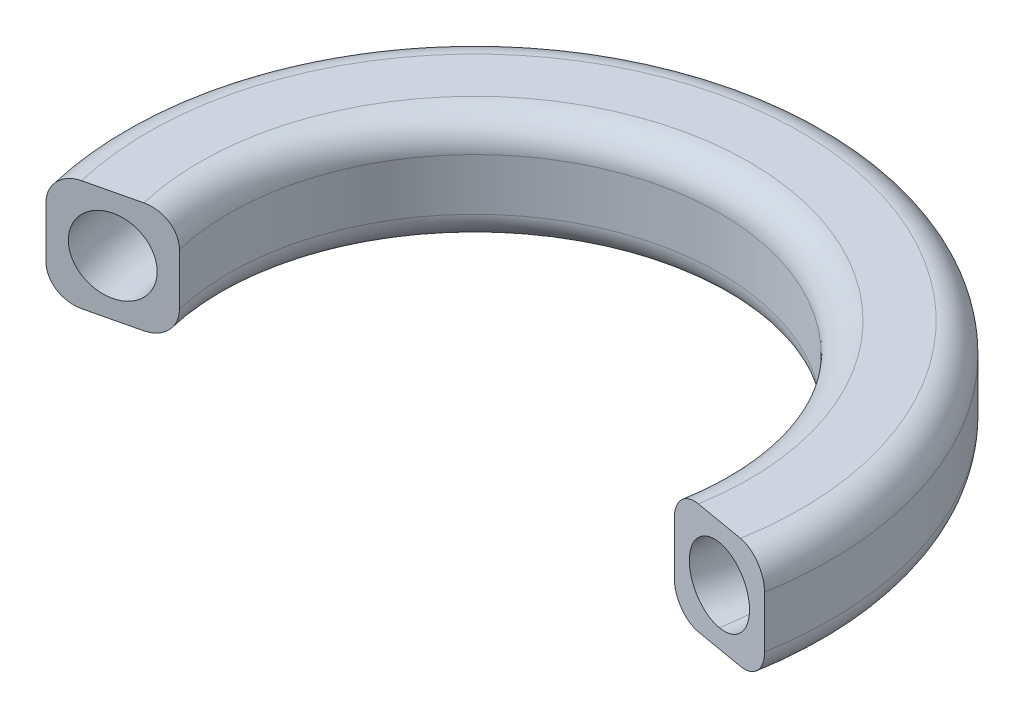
ISO-10303-21;
HEADER;
FILE_DESCRIPTION(('STEP AP214'),'2;1');
FILE_NAME('part.step','',(''),(''),'','','');
FILE_SCHEMA(('AUTOMOTIVE_DESIGN { 1 0 10303 214 1 1 1 1 }'));
ENDSEC;
DATA;
#1=APPLICATION_CONTEXT('core data for automotive mechanical design processes');
#2=APPLICATION_PROTOCOL_DEFINITION('international standard','automotive_design',2000,#1);
#3=PRODUCT_CONTEXT('',#1,'mechanical');
#4=PRODUCT('Part','Part','',(#3));
#5=PRODUCT_RELATED_PRODUCT_CATEGORY('part','',(#4));
#6=PRODUCT_DEFINITION_FORMATION('','',#4);
#7=PRODUCT_DEFINITION_CONTEXT('part definition',#1,'design');
#8=PRODUCT_DEFINITION('design','',#6,#7);
#9=PRODUCT_DEFINITION_SHAPE('','',#8);
#10=(LENGTH_UNIT() NAMED_UNIT(*) SI_UNIT(.MILLI.,.METRE.));
#11=(NAMED_UNIT(*) PLANE_ANGLE_UNIT() SI_UNIT($,.RADIAN.));
#12=(NAMED_UNIT(*) SI_UNIT($,.STERADIAN.) SOLID_ANGLE_UNIT());
#13=UNCERTAINTY_MEASURE_WITH_UNIT(LENGTH_MEASURE(1.E-05),#10,'distance_accuracy_value','');
#14=(GEOMETRIC_REPRESENTATION_CONTEXT(3) GLOBAL_UNCERTAINTY_ASSIGNED_CONTEXT((#13)) GLOBAL_UNIT_ASSIGNED_CONTEXT((#10,
#11,#12)) REPRESENTATION_CONTEXT('',''));
#15=CARTESIAN_POINT('',(0.,0.,0.));
#16=DIRECTION('',(0.,0.,1.));
#17=DIRECTION('',(1.,0.,0.));
#18=AXIS2_PLACEMENT_3D('',#15,#16,#17);
#19=CARTESIAN_POINT('',(-75.0783718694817,-15.,-3.46469167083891));
#20=DIRECTION('',(-0.230979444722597,0.,-0.972958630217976));
#21=DIRECTION('',(-0.972958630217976,0.,0.230979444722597));
#22=AXIS2_PLACEMENT_3D('',#19,#20,#21);
#23=PLANE('',#22);
#24=DIRECTION('',(0.,1.,0.));
#25=VECTOR('',#24,1.);
#26=CARTESIAN_POINT('',(-104.267130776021,15.,3.464691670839));
#27=LINE('',#26,#25);
#28=CARTESIAN_POINT('',(-104.267130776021,-7.,3.464691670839));
#29=VERTEX_POINT('',#28);
#30=CARTESIAN_POINT('',(-104.267130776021,7.,3.464691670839));
#31=VERTEX_POINT('',#30);
#32=EDGE_CURVE('E211',#29,#31,#27,.T.);
#33=ORIENTED_EDGE('',*,*,#32,.F.);
#34=CARTESIAN_POINT('',(-96.4834617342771,-7.,1.61685611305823));
#35=DIRECTION('',(-0.230979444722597,0.,-0.972958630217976));
#36=DIRECTION('',(-0.972958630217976,0.,0.230979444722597));
#37=AXIS2_PLACEMENT_3D('',#34,#35,#36);
#38=CIRCLE('',#37,8.);
#39=CARTESIAN_POINT('',(-96.4834617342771,-15.,1.61685611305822));
#40=VERTEX_POINT('',#39);
#41=EDGE_CURVE('E162',#29,#40,#38,.F.);
#42=ORIENTED_EDGE('',*,*,#41,.T.);
#43=DIRECTION('',(-0.972958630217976,0.,0.230979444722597));
#44=VECTOR('',#43,1.);
#45=CARTESIAN_POINT('',(-75.0783718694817,-15.,-3.46469167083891));
#46=LINE('',#45,#44);
#47=CARTESIAN_POINT('',(-82.8620409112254,-15.,-1.61685611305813));
#48=VERTEX_POINT('',#47);
#49=EDGE_CURVE('E207',#48,#40,#46,.T.);
#50=ORIENTED_EDGE('',*,*,#49,.F.);
#51=CARTESIAN_POINT('',(-82.8620409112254,-7.,-1.61685611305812));
#52=DIRECTION('',(-0.230979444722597,0.,-0.972958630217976));
#53=DIRECTION('',(-0.972958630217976,0.,0.230979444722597));
#54=AXIS2_PLACEMENT_3D('',#51,#52,#53);
#55=CIRCLE('',#54,8.);
#56=CARTESIAN_POINT('',(-75.0783718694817,-7.,-3.46469167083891));
#57=VERTEX_POINT('',#56);
#58=EDGE_CURVE('E156',#48,#57,#55,.F.);
#59=ORIENTED_EDGE('',*,*,#58,.T.);
#60=DIRECTION('',(0.,-1.,0.));
#61=VECTOR('',#60,1.);
#62=CARTESIAN_POINT('',(-75.0783718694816,15.,-3.46469167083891));
#63=LINE('',#62,#61);
#64=CARTESIAN_POINT('',(-75.0783718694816,7.,-3.46469167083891));
#65=VERTEX_POINT('',#64);
#66=EDGE_CURVE('E139',#65,#57,#63,.T.);
#67=ORIENTED_EDGE('',*,*,#66,.F.);
#68=CARTESIAN_POINT('',(-82.8620409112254,7.,-1.61685611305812));
#69=DIRECTION('',(-0.230979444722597,0.,-0.972958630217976));
#70=DIRECTION('',(-0.972958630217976,0.,0.230979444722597));
#71=AXIS2_PLACEMENT_3D('',#68,#69,#70);
#72=CIRCLE('',#71,8.);
#73=CARTESIAN_POINT('',(-82.8620409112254,15.,-1.61685611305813));
#74=VERTEX_POINT('',#73);
#75=EDGE_CURVE('E153',#65,#74,#72,.F.);
#76=ORIENTED_EDGE('',*,*,#75,.T.);
#77=DIRECTION('',(0.972958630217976,0.,-0.230979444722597));
#78=VECTOR('',#77,1.);
#79=CARTESIAN_POINT('',(-75.0783718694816,15.,-3.46469167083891));
#80=LINE('',#79,#78);
#81=CARTESIAN_POINT('',(-96.4834617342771,15.,1.61685611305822));
#82=VERTEX_POINT('',#81);
#83=EDGE_CURVE('E219',#82,#74,#80,.T.);
#84=ORIENTED_EDGE('',*,*,#83,.F.);
#85=CARTESIAN_POINT('',(-96.4834617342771,7.,1.61685611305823));
#86=DIRECTION('',(-0.230979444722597,0.,-0.972958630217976));
#87=DIRECTION('',(-0.972958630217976,0.,0.230979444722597));
#88=AXIS2_PLACEMENT_3D('',#85,#86,#87);
#89=CIRCLE('',#88,8.);
#90=EDGE_CURVE('E159',#82,#31,#89,.F.);
#91=ORIENTED_EDGE('',*,*,#90,.T.);
#92=EDGE_LOOP('',(#33,#42,#50,#59,#67,#76,#84,#91));
#93=FACE_BOUND('',#92,.T.);
#94=CARTESIAN_POINT('',(-89.6727513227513,0.,0.));
#95=DIRECTION('',(0.230979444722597,0.,0.972958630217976));
#96=DIRECTION('',(0.972958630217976,0.,-0.230979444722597));
#97=AXIS2_PLACEMENT_3D('',#94,#95,#96);
#98=CIRCLE('',#97,10.);
#99=CARTESIAN_POINT('',(-79.9431650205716,0.,-2.30979444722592));
#100=VERTEX_POINT('',#99);
#101=EDGE_CURVE('E123',#100,#100,#98,.T.);
#102=ORIENTED_EDGE('',*,*,#101,.F.);
#103=EDGE_LOOP('',(#102));
#104=FACE_BOUND('',#103,.T.);
#105=ADVANCED_FACE('F34',(#93,#104),#23,.F.);
#106=CARTESIAN_POINT('',(-10.5307952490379,0.,-18.7882243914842));
#107=DIRECTION('',(0.,1.,0.));
#108=DIRECTION('',(0.,0.,1.));
#109=AXIS2_PLACEMENT_3D('',#106,#107,#108);
#110=CYLINDRICAL_SURFACE('',#109,66.34154281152);
#111=ORIENTED_EDGE('',*,*,#66,.T.);
#112=CARTESIAN_POINT('',(-10.5307952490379,-7.,-18.7882243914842));
#113=DIRECTION('',(0.,1.,0.));
#114=DIRECTION('',(0.,0.,1.));
#115=AXIS2_PLACEMENT_3D('',#112,#113,#114);
#116=CIRCLE('',#115,66.34154281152);
#117=CARTESIAN_POINT('',(54.8369442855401,-7.,-7.4630784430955));
#118=VERTEX_POINT('',#117);
#119=EDGE_CURVE('E11',#57,#118,#116,.F.);
#120=ORIENTED_EDGE('',*,*,#119,.T.);
#121=DIRECTION('',(0.,-1.,0.));
#122=VECTOR('',#121,1.);
#123=CARTESIAN_POINT('',(54.8369442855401,15.,-7.4630784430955));
#124=LINE('',#123,#122);
#125=CARTESIAN_POINT('',(54.8369442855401,7.,-7.4630784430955));
#126=VERTEX_POINT('',#125);
#127=EDGE_CURVE('E198',#126,#118,#124,.T.);
#128=ORIENTED_EDGE('',*,*,#127,.F.);
#129=CARTESIAN_POINT('',(-10.5307952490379,7.,-18.7882243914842));
#130=DIRECTION('',(0.,-1.,0.));
#131=DIRECTION('',(0.,0.,-1.));
#132=AXIS2_PLACEMENT_3D('',#129,#130,#131);
#133=CIRCLE('',#132,66.34154281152);
#134=EDGE_CURVE('E43',#126,#65,#133,.F.);
#135=ORIENTED_EDGE('',*,*,#134,.T.);
#136=EDGE_LOOP('',(#111,#120,#128,#135));
#137=FACE_BOUND('',#136,.T.);
#138=ADVANCED_FACE('F195',(#137),#110,.F.);
#139=CARTESIAN_POINT('',(54.8369442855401,15.,-7.4630784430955));
#140=DIRECTION('',(0.,-1.,0.));
#141=DIRECTION('',(0.,0.,-1.));
#142=AXIS2_PLACEMENT_3D('',#139,#140,#141);
#143=PLANE('',#142);
#144=DIRECTION('',(-0.985321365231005,0.,-0.170709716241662));
#145=VECTOR('',#144,1.);
#146=CARTESIAN_POINT('',(54.8369442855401,15.,-7.4630784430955));
#147=LINE('',#146,#145);
#148=CARTESIAN_POINT('',(76.5140143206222,15.,-3.70746468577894));
#149=VERTEX_POINT('',#148);
#150=CARTESIAN_POINT('',(62.7195152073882,15.,-6.0974007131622));
#151=VERTEX_POINT('',#150);
#152=EDGE_CURVE('E230',#149,#151,#147,.T.);
#153=ORIENTED_EDGE('',*,*,#152,.F.);
#154=CARTESIAN_POINT('',(-10.5307952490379,15.,-18.7882243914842));
#155=DIRECTION('',(0.,-1.,0.));
#156=DIRECTION('',(0.,0.,-1.));
#157=AXIS2_PLACEMENT_3D('',#154,#155,#156);
#158=CIRCLE('',#157,88.34154281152);
#159=EDGE_CURVE('E184',#149,#82,#158,.F.);
#160=ORIENTED_EDGE('',*,*,#159,.T.);
#161=ORIENTED_EDGE('',*,*,#83,.T.);
#162=CARTESIAN_POINT('',(-10.5307952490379,15.,-18.7882243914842));
#163=DIRECTION('',(0.,-1.,0.));
#164=DIRECTION('',(0.,0.,-1.));
#165=AXIS2_PLACEMENT_3D('',#162,#163,#164);
#166=CIRCLE('',#165,74.34154281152);
#167=EDGE_CURVE('E50',#74,#151,#166,.T.);
#168=ORIENTED_EDGE('',*,*,#167,.T.);
#169=EDGE_LOOP('',(#153,#160,#161,#168));
#170=FACE_BOUND('',#169,.T.);
#171=ADVANCED_FACE('F254',(#170),#143,.F.);
#172=CARTESIAN_POINT('',(-10.5307952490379,0.,-18.7882243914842));
#173=DIRECTION('',(0.,1.,0.));
#174=DIRECTION('',(0.,0.,1.));
#175=AXIS2_PLACEMENT_3D('',#172,#173,#174);
#176=CYLINDRICAL_SURFACE('',#175,96.34154281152);
#177=DIRECTION('',(0.,1.,0.));
#178=VECTOR('',#177,1.);
#179=CARTESIAN_POINT('',(84.3965852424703,15.,-2.34178695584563));
#180=LINE('',#179,#178);
#181=CARTESIAN_POINT('',(84.3965852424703,-7.,-2.34178695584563));
#182=VERTEX_POINT('',#181);
#183=CARTESIAN_POINT('',(84.3965852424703,7.,-2.34178695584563));
#184=VERTEX_POINT('',#183);
#185=EDGE_CURVE('E228',#182,#184,#180,.T.);
#186=ORIENTED_EDGE('',*,*,#185,.F.);
#187=CARTESIAN_POINT('',(-10.5307952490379,-7.,-18.7882243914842));
#188=DIRECTION('',(0.,1.,0.));
#189=DIRECTION('',(0.,0.,1.));
#190=AXIS2_PLACEMENT_3D('',#187,#188,#189);
#191=CIRCLE('',#190,96.34154281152);
#192=EDGE_CURVE('E149',#182,#29,#191,.T.);
#193=ORIENTED_EDGE('',*,*,#192,.T.);
#194=ORIENTED_EDGE('',*,*,#32,.T.);
#195=CARTESIAN_POINT('',(-10.5307952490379,7.,-18.7882243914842));
#196=DIRECTION('',(0.,-1.,0.));
#197=DIRECTION('',(0.,0.,-1.));
#198=AXIS2_PLACEMENT_3D('',#195,#196,#197);
#199=CIRCLE('',#198,96.34154281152);
#200=EDGE_CURVE('E147',#31,#184,#199,.T.);
#201=ORIENTED_EDGE('',*,*,#200,.T.);
#202=EDGE_LOOP('',(#186,#193,#194,#201));
#203=FACE_BOUND('',#202,.T.);
#204=ADVANCED_FACE('F258',(#203),#176,.T.);
#205=CARTESIAN_POINT('',(54.8369442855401,-15.,-7.4630784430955));
#206=DIRECTION('',(0.,1.,0.));
#207=DIRECTION('',(0.,0.,1.));
#208=AXIS2_PLACEMENT_3D('',#205,#206,#207);
#209=PLANE('',#208);
#210=ORIENTED_EDGE('',*,*,#49,.T.);
#211=CARTESIAN_POINT('',(-10.5307952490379,-15.,-18.7882243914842));
#212=DIRECTION('',(0.,1.,0.));
#213=DIRECTION('',(0.,0.,1.));
#214=AXIS2_PLACEMENT_3D('',#211,#212,#213);
#215=CIRCLE('',#214,88.34154281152);
#216=CARTESIAN_POINT('',(76.5140143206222,-15.,-3.70746468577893));
#217=VERTEX_POINT('',#216);
#218=EDGE_CURVE('E169',#40,#217,#215,.F.);
#219=ORIENTED_EDGE('',*,*,#218,.T.);
#220=DIRECTION('',(0.985321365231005,0.,0.170709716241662));
#221=VECTOR('',#220,1.);
#222=CARTESIAN_POINT('',(54.8369442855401,-15.,-7.4630784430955));
#223=LINE('',#222,#221);
#224=CARTESIAN_POINT('',(62.7195152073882,-15.,-6.0974007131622));
#225=VERTEX_POINT('',#224);
#226=EDGE_CURVE('E224',#225,#217,#223,.T.);
#227=ORIENTED_EDGE('',*,*,#226,.F.);
#228=CARTESIAN_POINT('',(-10.5307952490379,-15.,-18.7882243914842));
#229=DIRECTION('',(0.,1.,0.));
#230=DIRECTION('',(0.,0.,1.));
#231=AXIS2_PLACEMENT_3D('',#228,#229,#230);
#232=CIRCLE('',#231,74.34154281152);
#233=EDGE_CURVE('E165',#225,#48,#232,.T.);
#234=ORIENTED_EDGE('',*,*,#233,.T.);
#235=EDGE_LOOP('',(#210,#219,#227,#234));
#236=FACE_BOUND('',#235,.T.);
#237=ADVANCED_FACE('F247',(#236),#209,.F.);
#238=CARTESIAN_POINT('',(54.8369442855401,-15.,-7.4630784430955));
#239=DIRECTION('',(-0.170709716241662,0.,0.985321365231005));
#240=DIRECTION('',(0.985321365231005,0.,0.170709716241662));
#241=AXIS2_PLACEMENT_3D('',#238,#239,#240);
#242=PLANE('',#241);
#243=CARTESIAN_POINT('',(69.6167647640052,0.,-4.90243269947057));
#244=DIRECTION('',(-0.170709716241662,0.,0.985321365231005));
#245=DIRECTION('',(0.985321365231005,0.,0.170709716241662));
#246=AXIS2_PLACEMENT_3D('',#243,#244,#245);
#247=CIRCLE('',#246,10.);
#248=CARTESIAN_POINT('',(69.6167647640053,10.,-4.90243269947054));
#249=VERTEX_POINT('',#248);
#250=CARTESIAN_POINT('',(69.6167647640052,-10.,-4.90243269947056));
#251=VERTEX_POINT('',#250);
#252=EDGE_CURVE('E128',#249,#251,#247,.T.);
#253=ORIENTED_EDGE('',*,*,#252,.F.);
#254=CARTESIAN_POINT('',(69.6167647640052,0.,-4.90243269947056));
#255=DIRECTION('',(0.170709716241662,0.,-0.985321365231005));
#256=DIRECTION('',(-0.985321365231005,0.,-0.170709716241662));
#257=AXIS2_PLACEMENT_3D('',#254,#255,#256);
#258=CIRCLE('',#257,10.);
#259=EDGE_CURVE('E112',#249,#251,#258,.T.);
#260=ORIENTED_EDGE('',*,*,#259,.T.);
#261=EDGE_LOOP('',(#253,#260));
#262=FACE_BOUND('',#261,.T.);
#263=ORIENTED_EDGE('',*,*,#226,.T.);
#264=CARTESIAN_POINT('',(76.5140143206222,-7.,-3.70746468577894));
#265=DIRECTION('',(-0.170709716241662,0.,0.985321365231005));
#266=DIRECTION('',(0.985321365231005,0.,0.170709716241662));
#267=AXIS2_PLACEMENT_3D('',#264,#265,#266);
#268=CIRCLE('',#267,8.);
#269=EDGE_CURVE('E179',#217,#182,#268,.T.);
#270=ORIENTED_EDGE('',*,*,#269,.T.);
#271=ORIENTED_EDGE('',*,*,#185,.T.);
#272=CARTESIAN_POINT('',(76.5140143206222,7.,-3.70746468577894));
#273=DIRECTION('',(-0.170709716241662,0.,0.985321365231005));
#274=DIRECTION('',(0.985321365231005,0.,0.170709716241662));
#275=AXIS2_PLACEMENT_3D('',#272,#273,#274);
#276=CIRCLE('',#275,8.);
#277=EDGE_CURVE('E57',#184,#149,#276,.T.);
#278=ORIENTED_EDGE('',*,*,#277,.T.);
#279=ORIENTED_EDGE('',*,*,#152,.T.);
#280=CARTESIAN_POINT('',(62.7195152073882,7.,-6.0974007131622));
#281=DIRECTION('',(-0.170709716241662,0.,0.985321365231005));
#282=DIRECTION('',(0.985321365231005,0.,0.170709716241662));
#283=AXIS2_PLACEMENT_3D('',#280,#281,#282);
#284=CIRCLE('',#283,8.);
#285=EDGE_CURVE('E172',#151,#126,#284,.T.);
#286=ORIENTED_EDGE('',*,*,#285,.T.);
#287=ORIENTED_EDGE('',*,*,#127,.T.);
#288=CARTESIAN_POINT('',(62.7195152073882,-7.,-6.0974007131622));
#289=DIRECTION('',(-0.170709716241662,0.,0.985321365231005));
#290=DIRECTION('',(0.985321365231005,0.,0.170709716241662));
#291=AXIS2_PLACEMENT_3D('',#288,#289,#290);
#292=CIRCLE('',#291,8.);
#293=EDGE_CURVE('E175',#118,#225,#292,.T.);
#294=ORIENTED_EDGE('',*,*,#293,.T.);
#295=EDGE_LOOP('',(#263,#270,#271,#278,#279,#286,#287,#294));
#296=FACE_BOUND('',#295,.T.);
#297=ADVANCED_FACE('F133',(#262,#296),#242,.T.);
#298=CARTESIAN_POINT('',(-89.6070662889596,0.,0.285244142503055));
#299=DIRECTION('',(-0.217817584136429,0.,-0.975989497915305));
#300=DIRECTION('',(-0.975989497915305,0.,0.217817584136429));
#301=AXIS2_PLACEMENT_3D('',#298,#299,#300);
#302=CIRCLE('',#301,10.);
#303=CARTESIAN_POINT('',(-10.5089790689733,15.,-18.0793745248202));
#304=DIRECTION('',(0.,-1.,0.));
#305=AXIS1_PLACEMENT('',#303,#304);
#306=SURFACE_OF_REVOLUTION('',#302,#305);
#307=CARTESIAN_POINT('',(78.0634470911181,0.,-39.8204124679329));
#308=CARTESIAN_POINT('',(78.0634490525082,-0.280953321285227,-39.820412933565));
#309=CARTESIAN_POINT('',(78.0519223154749,-0.561873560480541,-39.8176764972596));
#310=CARTESIAN_POINT('',(78.0058958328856,-1.12181107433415,-39.8067498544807));
#311=CARTESIAN_POINT('',(77.9713900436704,-1.40082782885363,-39.7985582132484));
#312=CARTESIAN_POINT('',(77.8795932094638,-1.95517499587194,-39.7767657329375));
#313=CARTESIAN_POINT('',(77.8222779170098,-2.23050116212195,-39.7631591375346));
#314=CARTESIAN_POINT('',(77.6852698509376,-2.77521418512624,-39.730633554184));
#315=CARTESIAN_POINT('',(77.6055766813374,-3.04460093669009,-39.7117144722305));
#316=CARTESIAN_POINT('',(77.4244252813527,-3.5753795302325,-39.668709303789));
#317=CARTESIAN_POINT('',(77.3229778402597,-3.83677526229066,-39.6446257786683));
#318=CARTESIAN_POINT('',(77.0990142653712,-4.34985680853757,-39.5914570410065));
#319=CARTESIAN_POINT('',(76.9764977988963,-4.60154246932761,-39.5623717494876));
#320=CARTESIAN_POINT('',(76.7113012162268,-5.09334893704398,-39.4994143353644));
#321=CARTESIAN_POINT('',(76.5686260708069,-5.33347257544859,-39.4655433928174));
#322=CARTESIAN_POINT('',(76.2641067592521,-5.80050958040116,-39.3932508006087));
#323=CARTESIAN_POINT('',(76.102263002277,-6.02742322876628,-39.3548292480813));
#324=CARTESIAN_POINT('',(75.7605346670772,-6.46645826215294,-39.2737032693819));
#325=CARTESIAN_POINT('',(75.5806480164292,-6.67857794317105,-39.2309983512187));
#326=CARTESIAN_POINT('',(75.2041280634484,-7.08648858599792,-39.1416128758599));
#327=CARTESIAN_POINT('',(75.0074947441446,-7.28227953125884,-39.0949323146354));
#328=CARTESIAN_POINT('',(74.5988715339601,-7.65614785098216,-38.9979255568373));
#329=CARTESIAN_POINT('',(74.3868810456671,-7.83422453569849,-38.9475992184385));
#330=CARTESIAN_POINT('',(73.9490574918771,-8.171389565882,-38.8436603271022));
#331=CARTESIAN_POINT('',(73.7232244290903,-8.33047791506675,-38.7900477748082));
#332=CARTESIAN_POINT('',(73.2593255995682,-8.62853248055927,-38.6799186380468));
#333=CARTESIAN_POINT('',(73.021260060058,-8.76749907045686,-38.6234021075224));
#334=CARTESIAN_POINT('',(72.5345849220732,-9.02432566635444,-38.5078658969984));
#335=CARTESIAN_POINT('',(72.2859753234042,-9.14218567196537,-38.4488462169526));
#336=CARTESIAN_POINT('',(71.7799800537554,-9.35596096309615,-38.3287234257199));
#337=CARTESIAN_POINT('',(71.5225944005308,-9.45187629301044,-38.267620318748));
#338=CARTESIAN_POINT('',(71.0008763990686,-9.62108063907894,-38.1437649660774));
#339=CARTESIAN_POINT('',(70.7365440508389,-9.69436965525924,-38.0810127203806));
#340=CARTESIAN_POINT('',(70.2028113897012,-9.81780045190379,-37.9543050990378));
#341=CARTESIAN_POINT('',(69.9334110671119,-9.8679421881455,-37.8903497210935));
#342=CARTESIAN_POINT('',(69.3914582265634,-9.94472174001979,-37.7616906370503));
#343=CARTESIAN_POINT('',(69.1189057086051,-9.97135955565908,-37.6969869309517));
#344=CARTESIAN_POINT('',(68.5725866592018,-10.0009418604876,-37.5672913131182));
#345=CARTESIAN_POINT('',(68.2988201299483,-10.0038863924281,-37.5022994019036));
#346=CARTESIAN_POINT('',(67.752018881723,-9.98606130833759,-37.3724893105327));
#347=CARTESIAN_POINT('',(67.4789841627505,-9.96529169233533,-37.3076711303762));
#348=CARTESIAN_POINT('',(66.935587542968,-9.90018595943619,-37.178669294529));
#349=CARTESIAN_POINT('',(66.665225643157,-9.85584983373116,-37.1144856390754));
#350=CARTESIAN_POINT('',(66.1290968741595,-9.74392627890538,-36.9872091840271));
#351=CARTESIAN_POINT('',(65.8633300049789,-9.67633884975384,-36.9241163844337));
#352=CARTESIAN_POINT('',(65.3382804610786,-9.51839311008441,-36.7994701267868));
#353=CARTESIAN_POINT('',(65.0789977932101,-9.42803477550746,-36.7379166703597));
#354=CARTESIAN_POINT('',(64.5687602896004,-9.22518965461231,-36.6167867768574));
#355=CARTESIAN_POINT('',(64.3178054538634,-9.11270286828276,-36.5572103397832));
#356=CARTESIAN_POINT('',(63.8260078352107,-8.86640059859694,-36.4404580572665));
#357=CARTESIAN_POINT('',(63.5851650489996,-8.73258512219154,-36.3832822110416));
#358=CARTESIAN_POINT('',(63.1153036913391,-8.44457679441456,-36.2717375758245));
#359=CARTESIAN_POINT('',(62.8862851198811,-8.29038394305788,-36.2173687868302));
#360=CARTESIAN_POINT('',(62.4417004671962,-7.96271715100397,-36.1118248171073));
#361=CARTESIAN_POINT('',(62.2261343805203,-7.78924321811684,-36.0606496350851));
#362=CARTESIAN_POINT('',(61.8099871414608,-7.42424750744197,-35.9618566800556));
#363=CARTESIAN_POINT('',(61.6094059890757,-7.23272572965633,-35.9142389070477));
#364=CARTESIAN_POINT('',(61.2246546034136,-6.83299590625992,-35.822899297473));
#365=CARTESIAN_POINT('',(61.0404843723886,-6.62478785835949,-35.7791774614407));
#366=CARTESIAN_POINT('',(60.6898642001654,-6.19316575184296,-35.6959405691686));
#367=CARTESIAN_POINT('',(60.5234142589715,-5.96975169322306,-35.6564255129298));
#368=CARTESIAN_POINT('',(60.2094180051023,-5.50930587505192,-35.5818831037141));
#369=CARTESIAN_POINT('',(60.061871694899,-5.27227411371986,-35.546855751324));
#370=CARTESIAN_POINT('',(59.7867316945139,-4.78627807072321,-35.4815377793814));
#371=CARTESIAN_POINT('',(59.6591380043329,-4.5373137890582,-35.451247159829));
#372=CARTESIAN_POINT('',(59.4248103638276,-4.02922270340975,-35.3956180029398));
#373=CARTESIAN_POINT('',(59.3180764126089,-3.77009589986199,-35.3702794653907));
#374=CARTESIAN_POINT('',(59.1262270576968,-3.24352199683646,-35.32473461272));
#375=CARTESIAN_POINT('',(59.0411116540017,-2.97607489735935,-35.304528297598));
#376=CARTESIAN_POINT('',(58.8931045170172,-2.43476180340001,-35.2693915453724));
#377=CARTESIAN_POINT('',(58.8302127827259,-2.16089580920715,-35.2544611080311));
#378=CARTESIAN_POINT('',(58.7271001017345,-1.60869193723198,-35.2299822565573));
#379=CARTESIAN_POINT('',(58.6868791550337,-1.3303540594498,-35.2204338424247));
#380=CARTESIAN_POINT('',(58.6293939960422,-0.771185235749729,-35.2067869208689));
#381=CARTESIAN_POINT('',(58.6121297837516,-0.490354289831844,-35.2026884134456));
#382=CARTESIAN_POINT('',(58.6006808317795,0.071804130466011,-35.199970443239));
#383=CARTESIAN_POINT('',(58.6064960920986,0.353131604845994,-35.2013509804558));
#384=CARTESIAN_POINT('',(58.6411647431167,0.914283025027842,-35.2095812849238));
#385=CARTESIAN_POINT('',(58.6700181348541,1.19410697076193,-35.2164310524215));
#386=CARTESIAN_POINT('',(58.7505579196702,1.750261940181,-35.2355511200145));
#387=CARTESIAN_POINT('',(58.8022443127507,2.02659296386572,-35.2478214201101));
#388=CARTESIAN_POINT('',(58.9280826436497,2.57379755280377,-35.2776953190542));
#389=CARTESIAN_POINT('',(59.0022345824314,2.84467111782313,-35.2952989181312));
#390=CARTESIAN_POINT('',(59.172476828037,3.37903502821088,-35.3357142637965));
#391=CARTESIAN_POINT('',(59.2685671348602,3.64252537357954,-35.3585260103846));
#392=CARTESIAN_POINT('',(59.4820029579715,4.160249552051,-35.4091954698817));
#393=CARTESIAN_POINT('',(59.5993484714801,4.41448338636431,-35.4370531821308));
#394=CARTESIAN_POINT('',(59.8544604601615,4.91188712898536,-35.4976165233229));
#395=CARTESIAN_POINT('',(59.9922269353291,5.15505703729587,-35.5303221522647));
#396=CARTESIAN_POINT('',(60.287201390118,5.62860410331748,-35.6003488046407));
#397=CARTESIAN_POINT('',(60.4444093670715,5.85898126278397,-35.6376698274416));
#398=CARTESIAN_POINT('',(60.7771491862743,6.30530502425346,-35.7166619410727));
#399=CARTESIAN_POINT('',(60.9526810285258,6.52125162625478,-35.7583330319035));
#400=CARTESIAN_POINT('',(61.3208207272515,6.93717910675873,-35.8457290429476));
#401=CARTESIAN_POINT('',(61.5134285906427,7.13715997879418,-35.891453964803));
#402=CARTESIAN_POINT('',(61.9143509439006,7.51973415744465,-35.98663254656));
#403=CARTESIAN_POINT('',(62.1226654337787,7.70232746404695,-36.0360862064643));
#404=CARTESIAN_POINT('',(62.5535201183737,8.0488284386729,-36.1383706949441));
#405=CARTESIAN_POINT('',(62.7760603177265,8.21273610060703,-36.1912015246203));
#406=CARTESIAN_POINT('',(63.2337842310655,8.52070043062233,-36.2998647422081));
#407=CARTESIAN_POINT('',(63.4689679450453,8.66475709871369,-36.3556971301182));
#408=CARTESIAN_POINT('',(63.950306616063,8.9319951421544,-36.4699664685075));
#409=CARTESIAN_POINT('',(64.1964615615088,9.05517653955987,-36.5284034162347));
#410=CARTESIAN_POINT('',(64.6979929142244,9.27978848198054,-36.6474664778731));
#411=CARTESIAN_POINT('',(64.9533693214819,9.38121902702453,-36.7080925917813));
#412=CARTESIAN_POINT('',(65.4715279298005,9.5616081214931,-36.8311029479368));
#413=CARTESIAN_POINT('',(65.7343101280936,9.64056667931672,-36.8934871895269));
#414=CARTESIAN_POINT('',(66.2654121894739,9.77545050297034,-37.0195703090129));
#415=CARTESIAN_POINT('',(66.5337320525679,9.83137576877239,-37.0832691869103));
#416=CARTESIAN_POINT('',(67.074002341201,9.9197954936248,-37.2115288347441));
#417=CARTESIAN_POINT('',(67.34595277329,9.95228991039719,-37.2760896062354));
#418=CARTESIAN_POINT('',(67.8915503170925,9.99361675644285,-37.4056139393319));
#419=CARTESIAN_POINT('',(68.1651974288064,10.0024491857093,-37.4705775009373));
#420=CARTESIAN_POINT('',(68.7122423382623,9.99638926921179,-37.6004454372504));
#421=CARTESIAN_POINT('',(68.9856401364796,9.98149696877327,-37.665349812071));
#422=CARTESIAN_POINT('',(69.5302432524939,9.92809355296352,-37.7946380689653));
#423=CARTESIAN_POINT('',(69.8014485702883,9.88958243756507,-37.8590219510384));
#424=CARTESIAN_POINT('',(70.3397391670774,9.78921508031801,-37.986811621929));
#425=CARTESIAN_POINT('',(70.6068244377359,9.72735879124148,-38.0502174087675));
#426=CARTESIAN_POINT('',(71.1349755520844,9.58074085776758,-38.1755999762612));
#427=CARTESIAN_POINT('',(71.3960413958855,9.49597921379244,-38.2375767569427));
#428=CARTESIAN_POINT('',(71.9103024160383,9.30415139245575,-38.3596618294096));
#429=CARTESIAN_POINT('',(72.1634974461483,9.1970848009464,-38.4197700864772));
#430=CARTESIAN_POINT('',(72.6602116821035,8.96140922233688,-38.5376895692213));
#431=CARTESIAN_POINT('',(72.9037308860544,8.8328002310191,-38.5955007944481));
#432=CARTESIAN_POINT('',(73.3793528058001,8.55495965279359,-38.7084129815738));
#433=CARTESIAN_POINT('',(73.6114559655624,8.40572886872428,-38.7635140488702));
#434=CARTESIAN_POINT('',(74.062605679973,8.08770195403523,-38.870616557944));
#435=CARTESIAN_POINT('',(74.2816522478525,7.91890584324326,-38.9226180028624));
#436=CARTESIAN_POINT('',(74.7051074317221,7.56296863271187,-39.023145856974));
#437=CARTESIAN_POINT('',(74.9095177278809,7.37582964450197,-39.0716726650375));
#438=CARTESIAN_POINT('',(75.3022794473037,6.98451635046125,-39.1649139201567));
#439=CARTESIAN_POINT('',(75.4906305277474,6.78034168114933,-39.2096282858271));
#440=CARTESIAN_POINT('',(75.8499744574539,6.35635940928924,-39.2949361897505));
#441=CARTESIAN_POINT('',(76.0209630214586,6.13654797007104,-39.3355287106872));
#442=CARTESIAN_POINT('',(76.3443105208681,5.68290361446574,-39.4122910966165));
#443=CARTESIAN_POINT('',(76.4966697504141,5.4490709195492,-39.448461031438));
#444=CARTESIAN_POINT('',(76.7817489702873,4.9689242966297,-39.5161385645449));
#445=CARTESIAN_POINT('',(76.9144592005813,4.72260424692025,-39.5476438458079));
#446=CARTESIAN_POINT('',(77.1592032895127,4.21934895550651,-39.6057458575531));
#447=CARTESIAN_POINT('',(77.2712375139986,3.96241390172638,-39.6323426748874));
#448=CARTESIAN_POINT('',(77.4737277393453,3.4400258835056,-39.6804136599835));
#449=CARTESIAN_POINT('',(77.5642065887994,3.17458227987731,-39.7018932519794));
#450=CARTESIAN_POINT('',(77.7230739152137,2.63689593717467,-39.7396082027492));
#451=CARTESIAN_POINT('',(77.7914681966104,2.36465500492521,-39.7558449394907));
#452=CARTESIAN_POINT('',(77.9199382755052,1.7467829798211,-39.7863436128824));
#453=CARTESIAN_POINT('',(77.9737084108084,1.3997479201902,-39.7991085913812));
#454=CARTESIAN_POINT('',(78.0454615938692,0.701791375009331,-39.816142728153));
#455=CARTESIAN_POINT('',(78.0634446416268,0.350869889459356,-39.820411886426));
#456=CARTESIAN_POINT('',(78.0634470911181,0.,-39.8204124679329));
#457=B_SPLINE_CURVE_WITH_KNOTS('',3,(#307,#308,#309,#310,#311,#312,#313,#314,#315,#316,#317,
#318,#319,#320,#321,#322,#323,#324,#325,#326,#327,#328,#329,#330,#331,#332,#333,#334,#335,#336,
#337,#338,#339,#340,#341,#342,#343,#344,#345,#346,#347,#348,#349,#350,#351,#352,#353,#354,#355,
#356,#357,#358,#359,#360,#361,#362,#363,#364,#365,#366,#367,#368,#369,#370,#371,#372,#373,#374,
#375,#376,#377,#378,#379,#380,#381,#382,#383,#384,#385,#386,#387,#388,#389,#390,#391,#392,#393,
#394,#395,#396,#397,#398,#399,#400,#401,#402,#403,#404,#405,#406,#407,#408,#409,#410,#411,#412,
#413,#414,#415,#416,#417,#418,#419,#420,#421,#422,#423,#424,#425,#426,#427,#428,#429,#430,#431,
#432,#433,#434,#435,#436,#437,#438,#439,#440,#441,#442,#443,#444,#445,#446,#447,#448,#449,#450,
#451,#452,#453,#454,#455,#456),.UNSPECIFIED.,.T.,.F.,(4,2,2,2,2,2,2,2,2,2,2,2,2,2,2,2,2,2,2,2,2,
2,2,2,2,2,2,2,2,2,2,2,2,2,2,2,2,2,2,2,2,2,2,2,2,2,2,2,2,2,2,2,2,2,2,2,2,2,2,2,2,2,2,2,2,2,2,2,2,
2,2,2,2,2,4),(0.,0.842553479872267,1.68532864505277,2.52900211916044,3.37269052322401,
4.21596145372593,5.05924570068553,5.90232237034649,6.74538104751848,7.58853667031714,
8.43169314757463,9.27488244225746,10.1180715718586,10.9612450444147,11.804418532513,
12.6475903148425,13.4907620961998,14.3339354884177,15.1771088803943,16.0202807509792,
16.8634526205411,17.7066248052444,18.5497969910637,19.3929700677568,20.2361431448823,
21.0793159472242,21.9224887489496,22.7656612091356,23.6088336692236,24.4520062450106,
25.2951788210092,26.1383515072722,26.9815241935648,27.8246968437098,28.6678694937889,
29.5110421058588,30.3542147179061,31.1973873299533,32.0405599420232,32.8837325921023,
33.7269052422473,34.5700779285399,35.413250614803,36.2564231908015,37.0995957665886,
37.9427682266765,38.7859406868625,39.6291134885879,40.4722862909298,41.3154593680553,
42.1586324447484,43.0018046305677,43.8449768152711,44.688148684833,45.5313205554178,
46.3744939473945,47.2176673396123,48.0608391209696,48.9040109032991,49.7471843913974,
50.5903578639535,51.4335469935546,52.2767362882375,53.119892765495,53.9630483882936,
54.8061070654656,55.6491837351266,56.4924679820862,57.3357389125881,58.1794273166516,
59.0231007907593,59.8658759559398,60.7084294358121,61.7606563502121,62.8128832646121),.UNSPECIFIED.);
#458=CARTESIAN_POINT('',(68.4725108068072,-9.99898458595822,-37.5435334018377));
#459=VERTEX_POINT('',#458);
#460=CARTESIAN_POINT('',(68.4725108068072,9.99898458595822,-37.5435334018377));
#461=VERTEX_POINT('',#460);
#462=EDGE_CURVE('E130',#459,#461,#457,.T.);
#463=ORIENTED_EDGE('',*,*,#462,.T.);
#464=CARTESIAN_POINT('',(68.4725108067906,9.99898458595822,-37.5435334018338));
#465=CARTESIAN_POINT('',(68.6705353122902,9.99903584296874,-36.7249594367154));
#466=CARTESIAN_POINT('',(68.8558226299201,9.99908531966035,-35.9033626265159));
#467=CARTESIAN_POINT('',(69.2007756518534,9.99918060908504,-34.2548054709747));
#468=CARTESIAN_POINT('',(69.3604412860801,9.99922642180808,-33.4278451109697));
#469=CARTESIAN_POINT('',(69.8008029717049,9.99935821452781,-30.9398374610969));
#470=CARTESIAN_POINT('',(70.0428372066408,9.9994385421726,-29.2717735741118));
#471=CARTESIAN_POINT('',(70.4226224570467,9.99958338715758,-25.9251902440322));
#472=CARTESIAN_POINT('',(70.5604490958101,9.99964791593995,-24.2466792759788));
#473=CARTESIAN_POINT('',(70.7315831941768,9.99976083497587,-20.8845662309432));
#474=CARTESIAN_POINT('',(70.7649128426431,9.9998092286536,-19.2009653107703));
#475=CARTESIAN_POINT('',(70.7342555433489,9.99987433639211,-16.4791536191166));
#476=CARTESIAN_POINT('',(70.7026226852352,9.99989608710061,-15.4404635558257));
#477=CARTESIAN_POINT('',(70.5995560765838,9.99993340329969,-13.3650621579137));
#478=CARTESIAN_POINT('',(70.5281239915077,9.99994896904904,-12.3283507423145));
#479=CARTESIAN_POINT('',(70.3456386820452,9.99997395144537,-10.2592877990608));
#480=CARTESIAN_POINT('',(70.234617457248,9.99998337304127,-9.22693342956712));
#481=CARTESIAN_POINT('',(69.9731138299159,9.9999961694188,-7.1673151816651));
#482=CARTESIAN_POINT('',(69.8226365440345,9.99999954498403,-6.14005066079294));
#483=CARTESIAN_POINT('',(69.6407208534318,9.99999998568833,-5.04488897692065));
#484=CARTESIAN_POINT('',(69.6287902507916,10.0000000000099,-4.97365256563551));
#485=CARTESIAN_POINT('',(69.6167647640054,10.,-4.90243269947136));
#486=B_SPLINE_CURVE_WITH_KNOTS('',3,(#464,#465,#466,#467,#468,#469,#470,#471,#472,#473,#474,
#475,#476,#477,#478,#479,#480,#481,#482,#483,#484,#485),.UNSPECIFIED.,.F.,.F.,(4,2,2,2,2,2,2,2,
2,2,4),(0.,2.52634231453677,5.05269153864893,10.1057288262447,15.1550956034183,20.2033901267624,
23.3202320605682,26.4369435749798,29.5511415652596,32.6649359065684,32.881621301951),.UNSPECIFIED.);
#487=EDGE_CURVE('E115',#461,#249,#486,.T.);
#488=ORIENTED_EDGE('',*,*,#487,.T.);
#489=ORIENTED_EDGE('',*,*,#252,.T.);
#490=CARTESIAN_POINT('',(68.4725108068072,-9.99898458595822,-37.5435334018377));
#491=CARTESIAN_POINT('',(68.6705353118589,-9.99903584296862,-36.7249594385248));
#492=CARTESIAN_POINT('',(68.8558226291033,-9.99908531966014,-35.9033626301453));
#493=CARTESIAN_POINT('',(69.2007756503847,-9.99918060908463,-34.2548054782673));
#494=CARTESIAN_POINT('',(69.3604412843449,-9.99922642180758,-33.4278451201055));
#495=CARTESIAN_POINT('',(69.80080296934,-9.99935821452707,-30.9398374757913));
#496=CARTESIAN_POINT('',(70.042837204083,-9.99943854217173,-29.2717735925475));
#497=CARTESIAN_POINT('',(70.4226224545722,-9.99958338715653,-25.9251902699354));
#498=CARTESIAN_POINT('',(70.5604490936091,-9.99964791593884,-24.2466793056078));
#499=CARTESIAN_POINT('',(70.7315831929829,-9.99976083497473,-20.8845662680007));
#500=CARTESIAN_POINT('',(70.7649128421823,-9.99980922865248,-19.2009653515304));
#501=CARTESIAN_POINT('',(70.734255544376,-9.99987433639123,-16.4791536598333));
#502=CARTESIAN_POINT('',(70.7026226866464,-9.99989608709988,-15.4404635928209));
#503=CARTESIAN_POINT('',(70.5995560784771,-9.99993340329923,-13.3650621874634));
#504=CARTESIAN_POINT('',(70.5281239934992,-9.99994896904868,-12.3283507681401));
#505=CARTESIAN_POINT('',(70.345638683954,-9.99997395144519,-10.2592878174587));
#506=CARTESIAN_POINT('',(70.2346174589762,-9.99998337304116,-9.22693344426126));
#507=CARTESIAN_POINT('',(69.973113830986,-9.99999616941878,-7.16731518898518));
#508=CARTESIAN_POINT('',(69.8226365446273,-9.99999954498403,-6.14005066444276));
#509=CARTESIAN_POINT('',(69.6407208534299,-9.99999998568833,-5.04488897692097));
#510=CARTESIAN_POINT('',(69.6287902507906,-10.0000000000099,-4.97365256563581));
#511=CARTESIAN_POINT('',(69.6167647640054,-10.,-4.90243269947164));
#512=B_SPLINE_CURVE_WITH_KNOTS('',3,(#490,#491,#492,#493,#494,#495,#496,#497,#498,#499,#500,
#501,#502,#503,#504,#505,#506,#507,#508,#509,#510,#511),.UNSPECIFIED.,.F.,.F.,(4,2,2,2,2,2,2,2,
2,2,4),(0.,2.52634230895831,5.05269152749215,10.1057288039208,15.1550955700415,20.2033900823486,
23.3202320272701,26.436943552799,29.5511415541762,32.664935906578,32.8816213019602),.UNSPECIFIED.);
#513=EDGE_CURVE('E118',#251,#459,#512,.F.);
#514=ORIENTED_EDGE('',*,*,#513,.T.);
#515=EDGE_LOOP('',(#463,#488,#489,#514));
#516=FACE_BOUND('',#515,.T.);
#517=ADVANCED_FACE('F127',(#516),#306,.T.);
#518=CARTESIAN_POINT('',(68.3338607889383,0.,-37.5106180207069));
#519=DIRECTION('',(0.230979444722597,0.,0.972958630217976));
#520=DIRECTION('',(0.972958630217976,0.,-0.230979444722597));
#521=AXIS2_PLACEMENT_3D('',#518,#519,#520);
#522=PLANE('',#521);
#523=CARTESIAN_POINT('',(68.6111608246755,0.,-37.5764487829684));
#524=DIRECTION('',(0.230979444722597,0.,0.972958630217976));
#525=DIRECTION('',(0.972958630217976,0.,-0.230979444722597));
#526=AXIS2_PLACEMENT_3D('',#523,#524,#525);
#527=CIRCLE('',#526,10.);
#528=EDGE_CURVE('E143',#461,#459,#527,.T.);
#529=ORIENTED_EDGE('',*,*,#528,.F.);
#530=ORIENTED_EDGE('',*,*,#462,.F.);
#531=EDGE_LOOP('',(#529,#530));
#532=FACE_BOUND('',#531,.T.);
#533=ADVANCED_FACE('F236',(#532),#522,.T.);
#534=CARTESIAN_POINT('',(-10.5307952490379,0.,-18.7882243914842));
#535=DIRECTION('',(0.,1.,0.));
#536=DIRECTION('',(0.,0.,1.));
#537=AXIS2_PLACEMENT_3D('',#534,#535,#536);
#538=TOROIDAL_SURFACE('',#537,81.34154281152,10.);
#539=ORIENTED_EDGE('',*,*,#101,.T.);
#540=EDGE_LOOP('',(#539));
#541=FACE_BOUND('',#540,.T.);
#542=ORIENTED_EDGE('',*,*,#528,.T.);
#543=ORIENTED_EDGE('',*,*,#513,.F.);
#544=ORIENTED_EDGE('',*,*,#259,.F.);
#545=ORIENTED_EDGE('',*,*,#487,.F.);
#546=EDGE_LOOP('',(#542,#543,#544,#545));
#547=FACE_BOUND('',#546,.T.);
#548=ADVANCED_FACE('F114',(#541,#547),#538,.F.);
#549=CARTESIAN_POINT('',(-10.5307952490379,-7.,-18.7882243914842));
#550=DIRECTION('',(0.,1.,0.));
#551=DIRECTION('',(0.,0.,1.));
#552=AXIS2_PLACEMENT_3D('',#549,#550,#551);
#553=TOROIDAL_SURFACE('',#552,88.34154281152,8.);
#554=ORIENTED_EDGE('',*,*,#269,.F.);
#555=ORIENTED_EDGE('',*,*,#218,.F.);
#556=ORIENTED_EDGE('',*,*,#41,.F.);
#557=ORIENTED_EDGE('',*,*,#192,.F.);
#558=EDGE_LOOP('',(#554,#555,#556,#557));
#559=FACE_BOUND('',#558,.T.);
#560=ADVANCED_FACE('F243',(#559),#553,.T.);
#561=CARTESIAN_POINT('',(-10.5307952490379,7.,-18.7882243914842));
#562=DIRECTION('',(0.,-1.,0.));
#563=DIRECTION('',(0.,0.,-1.));
#564=AXIS2_PLACEMENT_3D('',#561,#562,#563);
#565=TOROIDAL_SURFACE('',#564,88.34154281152,8.);
#566=ORIENTED_EDGE('',*,*,#277,.F.);
#567=ORIENTED_EDGE('',*,*,#200,.F.);
#568=ORIENTED_EDGE('',*,*,#90,.F.);
#569=ORIENTED_EDGE('',*,*,#159,.F.);
#570=EDGE_LOOP('',(#566,#567,#568,#569));
#571=FACE_BOUND('',#570,.T.);
#572=ADVANCED_FACE('F270',(#571),#565,.T.);
#573=CARTESIAN_POINT('',(-10.5307952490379,-7.,-18.7882243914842));
#574=DIRECTION('',(0.,1.,0.));
#575=DIRECTION('',(0.,0.,1.));
#576=AXIS2_PLACEMENT_3D('',#573,#574,#575);
#577=TOROIDAL_SURFACE('',#576,74.34154281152,8.);
#578=ORIENTED_EDGE('',*,*,#293,.F.);
#579=ORIENTED_EDGE('',*,*,#119,.F.);
#580=ORIENTED_EDGE('',*,*,#58,.F.);
#581=ORIENTED_EDGE('',*,*,#233,.F.);
#582=EDGE_LOOP('',(#578,#579,#580,#581));
#583=FACE_BOUND('',#582,.T.);
#584=ADVANCED_FACE('F273',(#583),#577,.T.);
#585=CARTESIAN_POINT('',(-10.5307952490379,7.,-18.7882243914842));
#586=DIRECTION('',(0.,-1.,0.));
#587=DIRECTION('',(0.,0.,-1.));
#588=AXIS2_PLACEMENT_3D('',#585,#586,#587);
#589=TOROIDAL_SURFACE('',#588,74.34154281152,8.);
#590=ORIENTED_EDGE('',*,*,#285,.F.);
#591=ORIENTED_EDGE('',*,*,#167,.F.);
#592=ORIENTED_EDGE('',*,*,#75,.F.);
#593=ORIENTED_EDGE('',*,*,#134,.F.);
#594=EDGE_LOOP('',(#590,#591,#592,#593));
#595=FACE_BOUND('',#594,.T.);
#596=ADVANCED_FACE('F36',(#595),#589,.T.);
#597=CLOSED_SHELL('',(#105,#138,#171,#204,#237,#297,#517,#533,#548,#560,#572,#584,#596));
#598=MANIFOLD_SOLID_BREP('B2',#597);
#599=ADVANCED_BREP_SHAPE_REPRESENTATION('',(#18,#598),#14);
#600=SHAPE_DEFINITION_REPRESENTATION(#9,#599);
ENDSEC;
END-ISO-10303-21;
